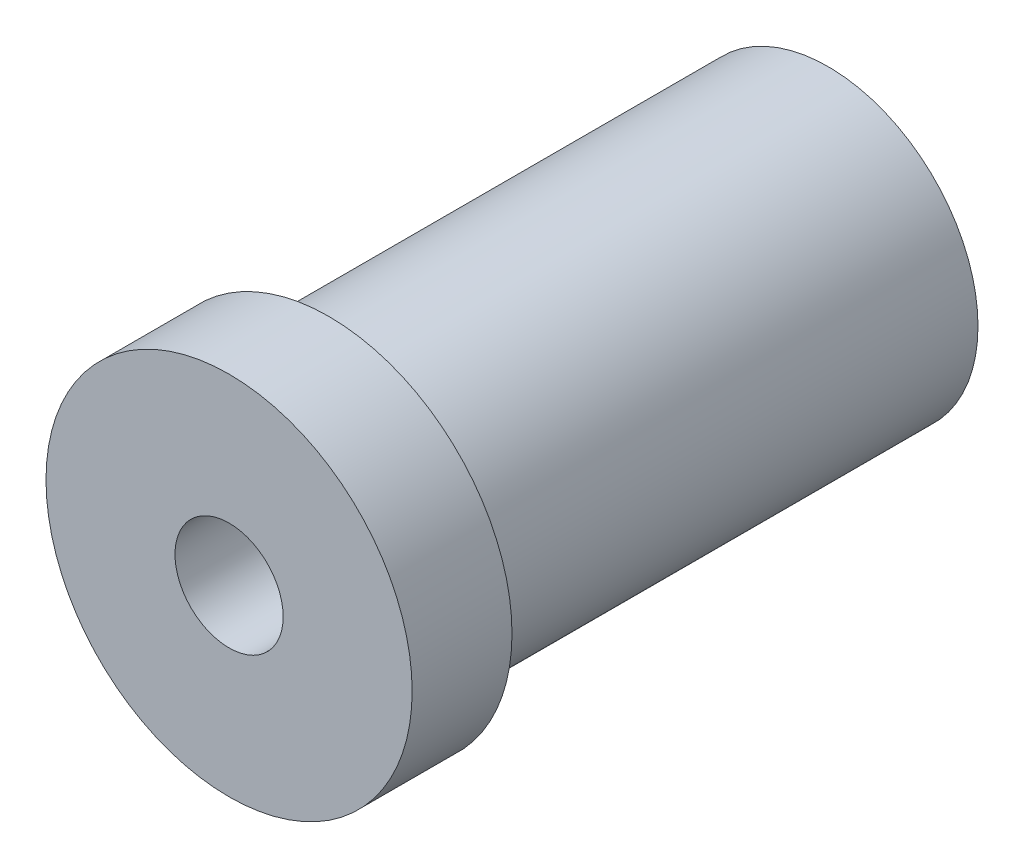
ISO-10303-21;
HEADER;
FILE_DESCRIPTION(('STEP AP214'),'2;1');
FILE_NAME('part.step','',(''),(''),'','','');
FILE_SCHEMA(('AUTOMOTIVE_DESIGN { 1 0 10303 214 1 1 1 1 }'));
ENDSEC;
DATA;
#1=APPLICATION_CONTEXT('core data for automotive mechanical design processes');
#2=APPLICATION_PROTOCOL_DEFINITION('international standard','automotive_design',2000,#1);
#3=PRODUCT_CONTEXT('',#1,'mechanical');
#4=PRODUCT('Part','Part','',(#3));
#5=PRODUCT_RELATED_PRODUCT_CATEGORY('part','',(#4));
#6=PRODUCT_DEFINITION_FORMATION('','',#4);
#7=PRODUCT_DEFINITION_CONTEXT('part definition',#1,'design');
#8=PRODUCT_DEFINITION('design','',#6,#7);
#9=PRODUCT_DEFINITION_SHAPE('','',#8);
#10=(LENGTH_UNIT() NAMED_UNIT(*) SI_UNIT(.MILLI.,.METRE.));
#11=(NAMED_UNIT(*) PLANE_ANGLE_UNIT() SI_UNIT($,.RADIAN.));
#12=(NAMED_UNIT(*) SI_UNIT($,.STERADIAN.) SOLID_ANGLE_UNIT());
#13=UNCERTAINTY_MEASURE_WITH_UNIT(LENGTH_MEASURE(1.E-05),#10,'distance_accuracy_value','');
#14=(GEOMETRIC_REPRESENTATION_CONTEXT(3) GLOBAL_UNCERTAINTY_ASSIGNED_CONTEXT((#13)) GLOBAL_UNIT_ASSIGNED_CONTEXT((#10,
#11,#12)) REPRESENTATION_CONTEXT('',''));
#15=CARTESIAN_POINT('',(0.,0.,0.));
#16=DIRECTION('',(0.,0.,1.));
#17=DIRECTION('',(1.,0.,0.));
#18=AXIS2_PLACEMENT_3D('',#15,#16,#17);
#19=CARTESIAN_POINT('',(0.,0.,0.));
#20=DIRECTION('',(0.,0.,1.));
#21=DIRECTION('',(1.,0.,0.));
#22=AXIS2_PLACEMENT_3D('',#19,#20,#21);
#23=CYLINDRICAL_SURFACE('',#22,11.);
#24=CARTESIAN_POINT('',(0.,0.,0.));
#25=DIRECTION('',(0.,0.,1.));
#26=DIRECTION('',(1.,0.,0.));
#27=AXIS2_PLACEMENT_3D('',#24,#25,#26);
#28=CIRCLE('',#27,11.);
#29=CARTESIAN_POINT('',(11.,0.,0.));
#30=VERTEX_POINT('',#29);
#31=EDGE_CURVE('E74',#30,#30,#28,.T.);
#32=ORIENTED_EDGE('',*,*,#31,.F.);
#33=EDGE_LOOP('',(#32));
#34=FACE_BOUND('',#33,.T.);
#35=CARTESIAN_POINT('',(0.,0.,-6.));
#36=DIRECTION('',(0.,0.,1.));
#37=DIRECTION('',(1.,0.,0.));
#38=AXIS2_PLACEMENT_3D('',#35,#36,#37);
#39=CIRCLE('',#38,11.);
#40=CARTESIAN_POINT('',(11.,0.,-6.));
#41=VERTEX_POINT('',#40);
#42=EDGE_CURVE('E77',#41,#41,#39,.T.);
#43=ORIENTED_EDGE('',*,*,#42,.T.);
#44=EDGE_LOOP('',(#43));
#45=FACE_BOUND('',#44,.T.);
#46=CARTESIAN_POINT('',(-11.,0.,-1.));
#47=CARTESIAN_POINT('',(-10.9999980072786,0.111357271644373,-1.00000431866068));
#48=CARTESIAN_POINT('',(-10.9982915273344,0.222771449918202,-1.00933175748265));
#49=CARTESIAN_POINT('',(-10.99164847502,0.442464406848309,-1.04637346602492));
#50=CARTESIAN_POINT('',(-10.9867091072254,0.550740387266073,-1.07410364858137));
#51=CARTESIAN_POINT('',(-10.9741532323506,0.760947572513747,-1.14707712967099));
#52=CARTESIAN_POINT('',(-10.9665390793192,0.862884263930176,-1.19230503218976));
#53=CARTESIAN_POINT('',(-10.949466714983,1.0577120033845,-1.29894733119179));
#54=CARTESIAN_POINT('',(-10.9400086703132,1.15060386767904,-1.36036026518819));
#55=CARTESIAN_POINT('',(-10.9201743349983,1.32576444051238,-1.4983659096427));
#56=CARTESIAN_POINT('',(-10.9097897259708,1.40791622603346,-1.57510584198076));
#57=CARTESIAN_POINT('',(-10.8893349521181,1.55825357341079,-1.74127035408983));
#58=CARTESIAN_POINT('',(-10.8792648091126,1.62643816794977,-1.83069581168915));
#59=CARTESIAN_POINT('',(-10.8604984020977,1.74738695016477,-2.02051272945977));
#60=CARTESIAN_POINT('',(-10.851812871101,1.80003313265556,-2.12098053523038));
#61=CARTESIAN_POINT('',(-10.836915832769,1.88765546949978,-2.32951865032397));
#62=CARTESIAN_POINT('',(-10.8307041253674,1.92263305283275,-2.43758834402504));
#63=CARTESIAN_POINT('',(-10.821541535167,1.97355197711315,-2.6570146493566));
#64=CARTESIAN_POINT('',(-10.8185558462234,1.98969666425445,-2.76832259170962));
#65=CARTESIAN_POINT('',(-10.8160783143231,2.00312248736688,-2.99210440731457));
#66=CARTESIAN_POINT('',(-10.8165861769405,2.00040521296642,-3.10457818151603));
#67=CARTESIAN_POINT('',(-10.8210066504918,1.97634934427,-3.32603191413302));
#68=CARTESIAN_POINT('',(-10.8248771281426,1.95524117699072,-3.43503786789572));
#69=CARTESIAN_POINT('',(-10.8355206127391,1.89536523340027,-3.64793501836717));
#70=CARTESIAN_POINT('',(-10.8422937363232,1.85659674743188,-3.75182600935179));
#71=CARTESIAN_POINT('',(-10.8580238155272,1.76227297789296,-3.95222279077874));
#72=CARTESIAN_POINT('',(-10.8669929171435,1.7066239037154,-4.04868344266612));
#73=CARTESIAN_POINT('',(-10.8860962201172,1.58018503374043,-4.23098473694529));
#74=CARTESIAN_POINT('',(-10.8962305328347,1.50939379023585,-4.31682436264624));
#75=CARTESIAN_POINT('',(-10.9167064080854,1.35343399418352,-4.47677899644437));
#76=CARTESIAN_POINT('',(-10.9270488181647,1.2680681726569,-4.55070168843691));
#77=CARTESIAN_POINT('',(-10.9466375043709,1.08604454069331,-4.68320513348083));
#78=CARTESIAN_POINT('',(-10.9558837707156,0.989386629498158,-4.74178574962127));
#79=CARTESIAN_POINT('',(-10.9722553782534,0.787327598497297,-4.84196738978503));
#80=CARTESIAN_POINT('',(-10.9793783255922,0.681916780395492,-4.88354926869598));
#81=CARTESIAN_POINT('',(-10.9906820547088,0.465448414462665,-4.9483631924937));
#82=CARTESIAN_POINT('',(-10.994863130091,0.354391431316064,-4.97159706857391));
#83=CARTESIAN_POINT('',(-10.9997719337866,0.131438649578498,-4.99878976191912));
#84=CARTESIAN_POINT('',(-11.0005468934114,0.019576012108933,-5.00301222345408));
#85=CARTESIAN_POINT('',(-10.998686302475,-0.203257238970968,-4.99276820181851));
#86=CARTESIAN_POINT('',(-10.9960509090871,-0.314227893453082,-4.97830257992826));
#87=CARTESIAN_POINT('',(-10.9876950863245,-0.531297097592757,-4.93131225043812));
#88=CARTESIAN_POINT('',(-10.9819973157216,-0.637425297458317,-4.89892013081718));
#89=CARTESIAN_POINT('',(-10.9681529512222,-0.84274471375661,-4.81713917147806));
#90=CARTESIAN_POINT('',(-10.9600061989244,-0.941935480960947,-4.7677492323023));
#91=CARTESIAN_POINT('',(-10.9420497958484,-1.13169524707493,-4.65278536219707));
#92=CARTESIAN_POINT('',(-10.932223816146,-1.22216445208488,-4.58704931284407));
#93=CARTESIAN_POINT('',(-10.9120428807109,-1.39088213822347,-4.44147962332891));
#94=CARTESIAN_POINT('',(-10.9016878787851,-1.46912954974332,-4.36164475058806));
#95=CARTESIAN_POINT('',(-10.8814603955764,-1.6121773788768,-4.18895311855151));
#96=CARTESIAN_POINT('',(-10.8715955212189,-1.67679836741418,-4.09594669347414));
#97=CARTESIAN_POINT('',(-10.8536151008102,-1.78949986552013,-3.90024381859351));
#98=CARTESIAN_POINT('',(-10.8454994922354,-1.83758096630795,-3.79754771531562));
#99=CARTESIAN_POINT('',(-10.8319954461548,-1.91557945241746,-3.58584925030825));
#100=CARTESIAN_POINT('',(-10.8265943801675,-1.9455810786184,-3.47687876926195));
#101=CARTESIAN_POINT('',(-10.8191012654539,-1.98683040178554,-3.25533701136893));
#102=CARTESIAN_POINT('',(-10.8170088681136,-1.99808007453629,-3.14276611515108));
#103=CARTESIAN_POINT('',(-10.8163869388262,-2.00144313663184,-2.91901462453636));
#104=CARTESIAN_POINT('',(-10.8178047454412,-1.99383937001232,-2.80783832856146));
#105=CARTESIAN_POINT('',(-10.8239270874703,-1.96032846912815,-2.58837636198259));
#106=CARTESIAN_POINT('',(-10.8286316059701,-1.93442142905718,-2.48009067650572));
#107=CARTESIAN_POINT('',(-10.8407757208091,-1.86515567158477,-2.26962380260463));
#108=CARTESIAN_POINT('',(-10.8482107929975,-1.82182581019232,-2.16743283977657));
#109=CARTESIAN_POINT('',(-10.8649817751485,-1.71897473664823,-1.97172555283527));
#110=CARTESIAN_POINT('',(-10.8743178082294,-1.65945247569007,-1.87820979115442));
#111=CARTESIAN_POINT('',(-10.8940032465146,-1.52491543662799,-1.70108712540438));
#112=CARTESIAN_POINT('',(-10.9043650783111,-1.44969415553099,-1.61763843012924));
#113=CARTESIAN_POINT('',(-10.9248399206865,-1.28632651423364,-1.46445291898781));
#114=CARTESIAN_POINT('',(-10.9349528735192,-1.19817718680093,-1.39471925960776));
#115=CARTESIAN_POINT('',(-10.9538897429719,-1.0105711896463,-1.27039970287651));
#116=CARTESIAN_POINT('',(-10.9627021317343,-0.911025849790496,-1.21594581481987));
#117=CARTESIAN_POINT('',(-10.9779326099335,-0.704073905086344,-1.12462078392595));
#118=CARTESIAN_POINT('',(-10.9843529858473,-0.59667492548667,-1.08773284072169));
#119=CARTESIAN_POINT('',(-10.9927407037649,-0.407441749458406,-1.04022456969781));
#120=CARTESIAN_POINT('',(-10.9954478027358,-0.32672542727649,-1.02516566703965));
#121=CARTESIAN_POINT('',(-10.9990781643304,-0.164016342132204,-1.0050519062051));
#122=CARTESIAN_POINT('',(-11.0000014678,-0.0820236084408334,-0.99999681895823));
#123=CARTESIAN_POINT('',(-11.,0.,-1.));
#124=B_SPLINE_CURVE_WITH_KNOTS('',3,(#46,#47,#48,#49,#50,#51,#52,#53,#54,#55,#56,#57,#58,#59,
#60,#61,#62,#63,#64,#65,#66,#67,#68,#69,#70,#71,#72,#73,#74,#75,#76,#77,#78,#79,#80,#81,#82,#83,
#84,#85,#86,#87,#88,#89,#90,#91,#92,#93,#94,#95,#96,#97,#98,#99,#100,#101,#102,#103,#104,#105,
#106,#107,#108,#109,#110,#111,#112,#113,#114,#115,#116,#117,#118,#119,#120,#121,#122,#123),
.UNSPECIFIED.,.T.,.F.,(4,2,2,2,2,2,2,2,2,2,2,2,2,2,2,2,2,2,2,2,2,2,2,2,2,2,2,2,2,2,2,2,2,2,2,2,
2,2,4),(0.,0.333771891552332,0.66783277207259,1.00160038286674,1.3353378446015,1.67245014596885,
2.00958578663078,2.3492195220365,2.6888257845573,3.02473021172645,3.36060633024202,
3.69233367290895,4.02407434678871,4.35769306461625,4.69134369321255,5.02993210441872,
5.36852353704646,5.70749527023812,6.04643316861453,6.38065600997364,6.71486344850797,
7.0466314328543,7.37842088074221,7.71364226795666,8.04889297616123,8.38831506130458,
8.72772501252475,9.06554101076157,9.40332141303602,9.73606509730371,10.0688070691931,
10.4010002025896,10.733214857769,11.0701111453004,11.4070848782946,11.7468860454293,
12.0863615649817,12.3322171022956,12.5780670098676),.UNSPECIFIED.);
#125=CARTESIAN_POINT('',(-11.,0.,-1.));
#126=VERTEX_POINT('',#125);
#127=EDGE_CURVE('E10',#126,#126,#124,.T.);
#128=ORIENTED_EDGE('',*,*,#127,.F.);
#129=EDGE_LOOP('',(#128));
#130=FACE_BOUND('',#129,.T.);
#131=ADVANCED_FACE('F16',(#34,#45,#130),#23,.T.);
#132=CARTESIAN_POINT('',(0.,3.25,-8.));
#133=DIRECTION('',(0.,0.,-1.));
#134=DIRECTION('',(-1.,0.,0.));
#135=AXIS2_PLACEMENT_3D('',#132,#133,#134);
#136=PLANE('',#135);
#137=CARTESIAN_POINT('',(0.,0.,-8.));
#138=DIRECTION('',(0.,0.,1.));
#139=DIRECTION('',(1.,0.,0.));
#140=AXIS2_PLACEMENT_3D('',#137,#138,#139);
#141=CIRCLE('',#140,3.);
#142=CARTESIAN_POINT('',(3.,0.,-8.));
#143=VERTEX_POINT('',#142);
#144=EDGE_CURVE('E100',#143,#143,#141,.T.);
#145=ORIENTED_EDGE('',*,*,#144,.F.);
#146=EDGE_LOOP('',(#145));
#147=FACE_BOUND('',#146,.T.);
#148=CARTESIAN_POINT('',(0.,0.,-8.));
#149=DIRECTION('',(0.,0.,1.));
#150=DIRECTION('',(1.,0.,0.));
#151=AXIS2_PLACEMENT_3D('',#148,#149,#150);
#152=CIRCLE('',#151,3.25);
#153=CARTESIAN_POINT('',(3.25,0.,-8.));
#154=VERTEX_POINT('',#153);
#155=EDGE_CURVE('E28',#154,#154,#152,.T.);
#156=ORIENTED_EDGE('',*,*,#155,.T.);
#157=EDGE_LOOP('',(#156));
#158=FACE_BOUND('',#157,.T.);
#159=ADVANCED_FACE('F18',(#147,#158),#136,.F.);
#160=CARTESIAN_POINT('',(0.,0.,0.));
#161=DIRECTION('',(0.,0.,1.));
#162=DIRECTION('',(1.,0.,0.));
#163=AXIS2_PLACEMENT_3D('',#160,#161,#162);
#164=CYLINDRICAL_SURFACE('',#163,3.25);
#165=ORIENTED_EDGE('',*,*,#155,.F.);
#166=EDGE_LOOP('',(#165));
#167=FACE_BOUND('',#166,.T.);
#168=CARTESIAN_POINT('',(0.,0.,0.));
#169=DIRECTION('',(0.,0.,1.));
#170=DIRECTION('',(1.,0.,0.));
#171=AXIS2_PLACEMENT_3D('',#168,#169,#170);
#172=CIRCLE('',#171,3.25);
#173=CARTESIAN_POINT('',(3.25,0.,0.));
#174=VERTEX_POINT('',#173);
#175=EDGE_CURVE('E73',#174,#174,#172,.T.);
#176=ORIENTED_EDGE('',*,*,#175,.T.);
#177=EDGE_LOOP('',(#176));
#178=FACE_BOUND('',#177,.T.);
#179=ADVANCED_FACE('F51',(#167,#178),#164,.F.);
#180=CARTESIAN_POINT('',(0.,3.25,0.));
#181=DIRECTION('',(0.,0.,-1.));
#182=DIRECTION('',(-1.,0.,0.));
#183=AXIS2_PLACEMENT_3D('',#180,#181,#182);
#184=PLANE('',#183);
#185=ORIENTED_EDGE('',*,*,#175,.F.);
#186=EDGE_LOOP('',(#185));
#187=FACE_BOUND('',#186,.T.);
#188=ORIENTED_EDGE('',*,*,#31,.T.);
#189=EDGE_LOOP('',(#188));
#190=FACE_BOUND('',#189,.T.);
#191=ADVANCED_FACE('F60',(#187,#190),#184,.F.);
#192=CARTESIAN_POINT('',(0.,11.,-6.));
#193=DIRECTION('',(0.,0.,1.));
#194=DIRECTION('',(1.,0.,0.));
#195=AXIS2_PLACEMENT_3D('',#192,#193,#194);
#196=PLANE('',#195);
#197=ORIENTED_EDGE('',*,*,#42,.F.);
#198=EDGE_LOOP('',(#197));
#199=FACE_BOUND('',#198,.T.);
#200=CARTESIAN_POINT('',(0.,0.,-6.));
#201=DIRECTION('',(0.,0.,1.));
#202=DIRECTION('',(1.,0.,0.));
#203=AXIS2_PLACEMENT_3D('',#200,#201,#202);
#204=CIRCLE('',#203,9.);
#205=CARTESIAN_POINT('',(9.,0.,-6.));
#206=VERTEX_POINT('',#205);
#207=EDGE_CURVE('E82',#206,#206,#204,.T.);
#208=ORIENTED_EDGE('',*,*,#207,.T.);
#209=EDGE_LOOP('',(#208));
#210=FACE_BOUND('',#209,.T.);
#211=ADVANCED_FACE('F58',(#199,#210),#196,.F.);
#212=CARTESIAN_POINT('',(0.,0.,0.));
#213=DIRECTION('',(0.,0.,1.));
#214=DIRECTION('',(1.,0.,0.));
#215=AXIS2_PLACEMENT_3D('',#212,#213,#214);
#216=CYLINDRICAL_SURFACE('',#215,9.);
#217=ORIENTED_EDGE('',*,*,#207,.F.);
#218=EDGE_LOOP('',(#217));
#219=FACE_BOUND('',#218,.T.);
#220=CARTESIAN_POINT('',(0.,0.,-36.));
#221=DIRECTION('',(0.,0.,1.));
#222=DIRECTION('',(1.,0.,0.));
#223=AXIS2_PLACEMENT_3D('',#220,#221,#222);
#224=CIRCLE('',#223,9.);
#225=CARTESIAN_POINT('',(9.,0.,-36.));
#226=VERTEX_POINT('',#225);
#227=EDGE_CURVE('E85',#226,#226,#224,.T.);
#228=ORIENTED_EDGE('',*,*,#227,.T.);
#229=EDGE_LOOP('',(#228));
#230=FACE_BOUND('',#229,.T.);
#231=ADVANCED_FACE('F132',(#219,#230),#216,.T.);
#232=CARTESIAN_POINT('',(0.,9.,-36.));
#233=DIRECTION('',(0.,0.,1.));
#234=DIRECTION('',(1.,0.,0.));
#235=AXIS2_PLACEMENT_3D('',#232,#233,#234);
#236=PLANE('',#235);
#237=ORIENTED_EDGE('',*,*,#227,.F.);
#238=EDGE_LOOP('',(#237));
#239=FACE_BOUND('',#238,.T.);
#240=CARTESIAN_POINT('',(0.,0.,-36.));
#241=DIRECTION('',(0.,0.,1.));
#242=DIRECTION('',(1.,0.,0.));
#243=AXIS2_PLACEMENT_3D('',#240,#241,#242);
#244=CIRCLE('',#243,3.1);
#245=CARTESIAN_POINT('',(3.1,0.,-36.));
#246=VERTEX_POINT('',#245);
#247=EDGE_CURVE('E88',#246,#246,#244,.T.);
#248=ORIENTED_EDGE('',*,*,#247,.T.);
#249=EDGE_LOOP('',(#248));
#250=FACE_BOUND('',#249,.T.);
#251=ADVANCED_FACE('F129',(#239,#250),#236,.F.);
#252=CARTESIAN_POINT('',(0.,0.,0.));
#253=DIRECTION('',(0.,0.,1.));
#254=DIRECTION('',(1.,0.,0.));
#255=AXIS2_PLACEMENT_3D('',#252,#253,#254);
#256=CYLINDRICAL_SURFACE('',#255,3.1);
#257=ORIENTED_EDGE('',*,*,#247,.F.);
#258=EDGE_LOOP('',(#257));
#259=FACE_BOUND('',#258,.T.);
#260=CARTESIAN_POINT('',(0.,0.,-34.));
#261=DIRECTION('',(0.,0.,1.));
#262=DIRECTION('',(1.,0.,0.));
#263=AXIS2_PLACEMENT_3D('',#260,#261,#262);
#264=CIRCLE('',#263,3.1);
#265=CARTESIAN_POINT('',(3.1,0.,-34.));
#266=VERTEX_POINT('',#265);
#267=EDGE_CURVE('E91',#266,#266,#264,.T.);
#268=ORIENTED_EDGE('',*,*,#267,.T.);
#269=EDGE_LOOP('',(#268));
#270=FACE_BOUND('',#269,.T.);
#271=ADVANCED_FACE('F125',(#259,#270),#256,.F.);
#272=CARTESIAN_POINT('',(0.,0.,-29.));
#273=DIRECTION('',(0.,0.,1.));
#274=DIRECTION('',(1.,0.,0.));
#275=AXIS2_PLACEMENT_3D('',#272,#273,#274);
#276=CONICAL_SURFACE('',#275,3.53744331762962,0.0872664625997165);
#277=ORIENTED_EDGE('',*,*,#267,.F.);
#278=EDGE_LOOP('',(#277));
#279=FACE_BOUND('',#278,.T.);
#280=CARTESIAN_POINT('',(0.,0.,-29.));
#281=DIRECTION('',(0.,0.,1.));
#282=DIRECTION('',(1.,0.,0.));
#283=AXIS2_PLACEMENT_3D('',#280,#281,#282);
#284=CIRCLE('',#283,3.53744331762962);
#285=CARTESIAN_POINT('',(3.53744331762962,0.,-29.));
#286=VERTEX_POINT('',#285);
#287=EDGE_CURVE('E94',#286,#286,#284,.T.);
#288=ORIENTED_EDGE('',*,*,#287,.T.);
#289=EDGE_LOOP('',(#288));
#290=FACE_BOUND('',#289,.T.);
#291=ADVANCED_FACE('F118',(#279,#290),#276,.F.);
#292=CARTESIAN_POINT('',(0.,3.53744331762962,-29.));
#293=DIRECTION('',(0.,0.,1.));
#294=DIRECTION('',(1.,0.,0.));
#295=AXIS2_PLACEMENT_3D('',#292,#293,#294);
#296=PLANE('',#295);
#297=ORIENTED_EDGE('',*,*,#287,.F.);
#298=EDGE_LOOP('',(#297));
#299=FACE_BOUND('',#298,.T.);
#300=CARTESIAN_POINT('',(0.,0.,-29.));
#301=DIRECTION('',(0.,0.,1.));
#302=DIRECTION('',(1.,0.,0.));
#303=AXIS2_PLACEMENT_3D('',#300,#301,#302);
#304=CIRCLE('',#303,3.);
#305=CARTESIAN_POINT('',(3.,0.,-29.));
#306=VERTEX_POINT('',#305);
#307=EDGE_CURVE('E97',#306,#306,#304,.T.);
#308=ORIENTED_EDGE('',*,*,#307,.T.);
#309=EDGE_LOOP('',(#308));
#310=FACE_BOUND('',#309,.T.);
#311=ADVANCED_FACE('F112',(#299,#310),#296,.F.);
#312=CARTESIAN_POINT('',(0.,0.,0.));
#313=DIRECTION('',(0.,0.,1.));
#314=DIRECTION('',(1.,0.,0.));
#315=AXIS2_PLACEMENT_3D('',#312,#313,#314);
#316=CYLINDRICAL_SURFACE('',#315,3.);
#317=ORIENTED_EDGE('',*,*,#307,.F.);
#318=EDGE_LOOP('',(#317));
#319=FACE_BOUND('',#318,.T.);
#320=ORIENTED_EDGE('',*,*,#144,.T.);
#321=EDGE_LOOP('',(#320));
#322=FACE_BOUND('',#321,.T.);
#323=ADVANCED_FACE('F41',(#319,#322),#316,.F.);
#324=CARTESIAN_POINT('',(-11.,0.,-3.));
#325=DIRECTION('',(-1.,0.,0.));
#326=DIRECTION('',(0.,0.,1.));
#327=AXIS2_PLACEMENT_3D('',#324,#325,#326);
#328=CYLINDRICAL_SURFACE('',#327,2.);
#329=CARTESIAN_POINT('',(-6.5,0.,-3.));
#330=DIRECTION('',(-1.,0.,0.));
#331=DIRECTION('',(0.,0.,1.));
#332=AXIS2_PLACEMENT_3D('',#329,#330,#331);
#333=CIRCLE('',#332,2.);
#334=CARTESIAN_POINT('',(-6.5,0.,-1.));
#335=VERTEX_POINT('',#334);
#336=EDGE_CURVE('E103',#335,#335,#333,.T.);
#337=ORIENTED_EDGE('',*,*,#336,.F.);
#338=EDGE_LOOP('',(#337));
#339=FACE_BOUND('',#338,.T.);
#340=ORIENTED_EDGE('',*,*,#127,.T.);
#341=EDGE_LOOP('',(#340));
#342=FACE_BOUND('',#341,.T.);
#343=ADVANCED_FACE('F33',(#339,#342),#328,.F.);
#344=CARTESIAN_POINT('',(-5.34529946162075,0.,-3.));
#345=DIRECTION('',(-1.,0.,0.));
#346=DIRECTION('',(0.,0.,1.));
#347=AXIS2_PLACEMENT_3D('',#344,#345,#346);
#348=CONICAL_SURFACE('',#347,0.,1.0471975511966);
#349=ORIENTED_EDGE('',*,*,#336,.T.);
#350=EDGE_LOOP('',(#349));
#351=FACE_BOUND('',#350,.T.);
#352=CARTESIAN_POINT('',(-5.34529946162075,0.,-3.));
#353=VERTEX_POINT('',#352);
#354=VERTEX_LOOP('',#353);
#355=FACE_BOUND('',#354,.T.);
#356=ADVANCED_FACE('F31',(#351,#355),#348,.F.);
#357=CLOSED_SHELL('',(#131,#159,#179,#191,#211,#231,#251,#271,#291,#311,#323,#343,#356));
#358=MANIFOLD_SOLID_BREP('B1',#357);
#359=ADVANCED_BREP_SHAPE_REPRESENTATION('',(#18,#358),#14);
#360=SHAPE_DEFINITION_REPRESENTATION(#9,#359);
ENDSEC;
END-ISO-10303-21;
